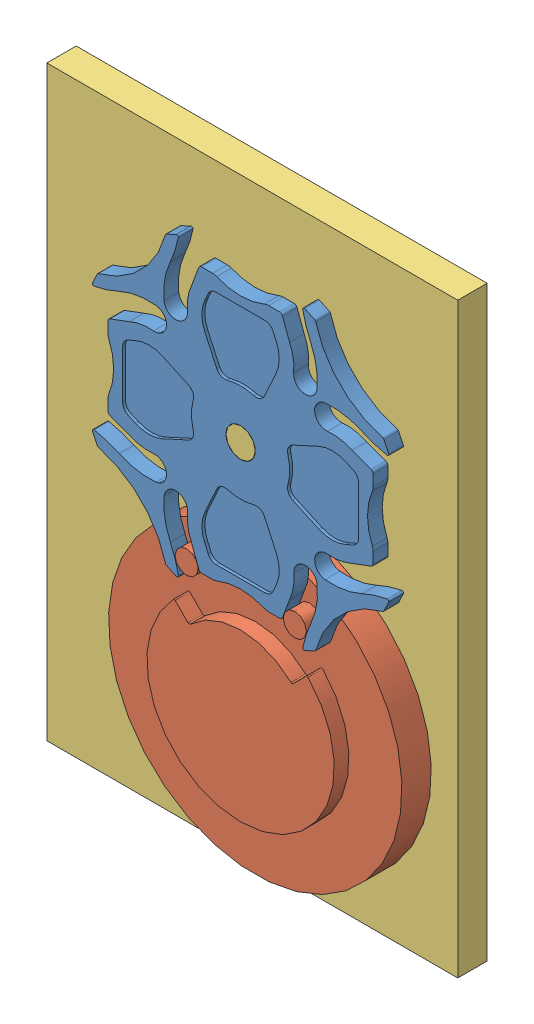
SolidWorks assembly stargeneva.SLDASM, configuration Default (file format 11000). Lengths in mm.
Overall size (700 1000 125.07).
3 component instances, 3 part files, 2 mates.
Components (placement in the parent):
- driven wheel-1: driven wheel.sldprt [Default] at (127.6933 111.0874 -195.4659) size (505.12 505.12 25)
- driving wheel-1: driving wheel.sldprt [Default] at (127.6936 111.151 -195.4531) x (1 0 0) z (0 -0.000161 1) size (500 500.01 75.07)
- base1-1: base1.SLDPRT [Default] at (127.1577 113.8147 -195.4659) size (700 1000 125)
Mates (geometry in assembly coordinates):
- Hinge1: hinge: cylinder of assembly; cylinder of assembly; plane of assembly; plane of assembly; cylinder of base1-1 through (134.1577 516.8147 -182.9659) axis (0 0 -1) radius 25; cylinder of driven wheel-1 through (134.1577 516.8147 -207.9659) axis (0 0 1) radius 25; plane of base1-1 through (134.1577 516.8147 -182.9659) normal (0 0 1); plane of driven wheel-1 through (261.7954 760.3996 -182.9659) normal (0 0 1)
- Hinge2: hinge: cylinder of assembly; cylinder of assembly; plane of assembly; plane of assembly; cylinder of base1-1 through (134.1577 116.8147 -207.9659) axis (0 0 -1) radius 25; cylinder of driving wheel-1 through (134.1577 116.8147 -207.9659) axis (0 0 -1) radius 25; plane of base1-1 through (134.1577 116.8147 -207.9659) normal (0 0 1); plane of driving wheel-1 through (134.1577 116.8147 -207.9659) normal (0 0 -1)
